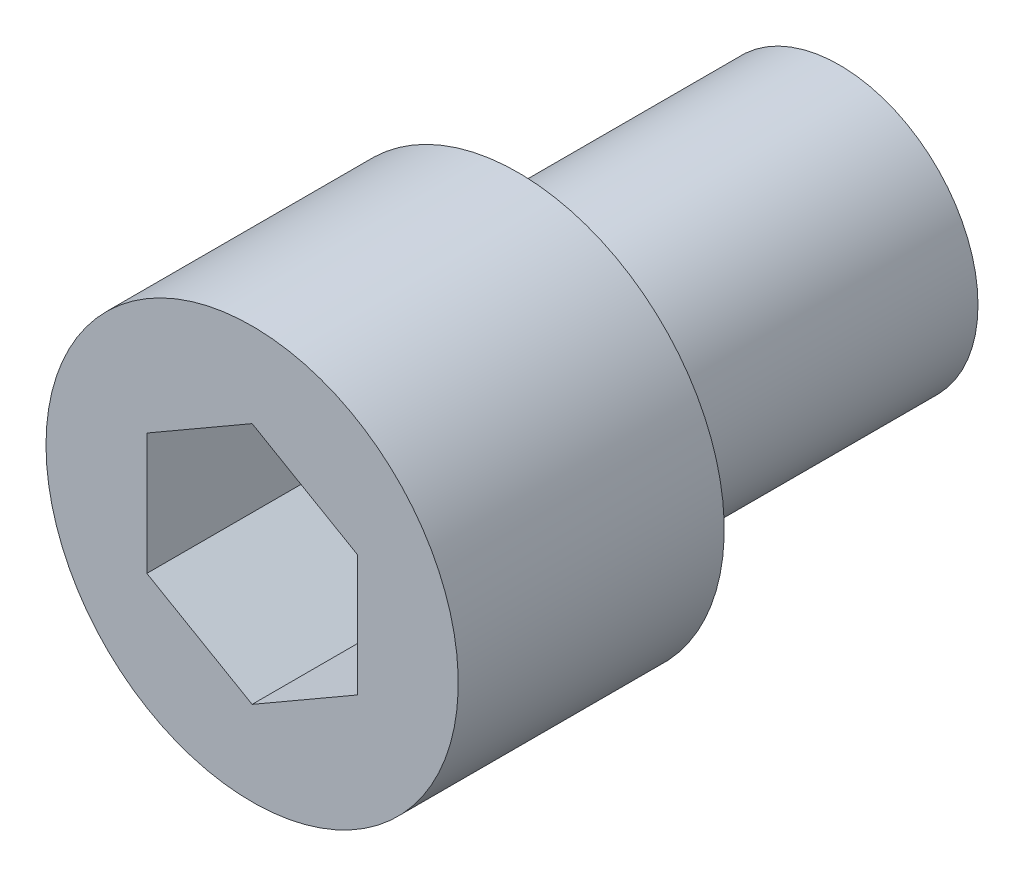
from build123d import *

# Parameters (mm, degrees)
SKETCH1_R           = 3.175
BASE_EXTRUDE_DEPTH  = 7.366
SKETCH2_R           = 4.7244
BOSS_EXTRUDE1_DEPTH = 6.096
CUT_EXTRUDE1_DEPTH  = 3.556
SKETCH6_R           = 1.5875
CUT_EXTRUDE2_DEPTH  = 16.028817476


with BuildPart() as part:
    # Sketch1 → Base-Extrude (new body)
    with BuildSketch(Plane.XY):
        Circle(SKETCH1_R)
    extrude(amount=BASE_EXTRUDE_DEPTH)

    # Sketch2 → Boss-Extrude1 (add)
    with BuildSketch(Plane.XY.offset(7.366)):
        with Locations(Location((0, 0, 0), (0, 0, 180))):
            Circle(SKETCH2_R)
    extrude(amount=BOSS_EXTRUDE1_DEPTH)

    # Sketch5 → Cut-Extrude1 (cut)
    with BuildSketch(Plane.XY.offset(13.462)):
        Polygon((1.125e-06, 2.7862911), (2.413, 1.39314555), (2.413, -1.39314555), (1.125e-06, -2.7862911), (-2.41299775, -1.39314555), (-2.41299775, 1.39314555), align=None)
    extrude(amount=-CUT_EXTRUDE1_DEPTH, mode=Mode.SUBTRACT)

    # Sketch6 → Cut-Extrude2 (cut, through all)
    with BuildSketch(Plane(origin=(0, 0, 0), x_dir=(-1, 0, 0), z_dir=(0, 0, -1))):
        Circle(SKETCH6_R)
    extrude(amount=-CUT_EXTRUDE2_DEPTH, mode=Mode.SUBTRACT)


solid = part.part
